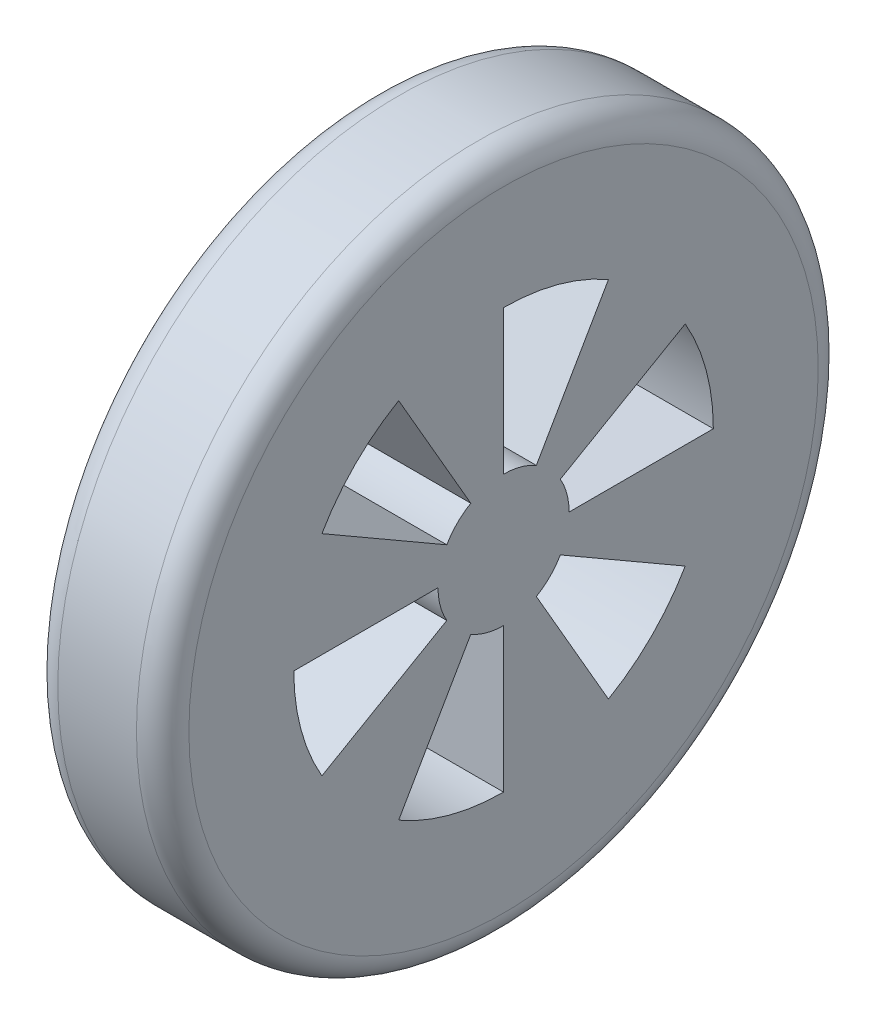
ISO-10303-21;
HEADER;
FILE_DESCRIPTION(('STEP AP214'),'2;1');
FILE_NAME('part.step','',(''),(''),'','','');
FILE_SCHEMA(('AUTOMOTIVE_DESIGN { 1 0 10303 214 1 1 1 1 }'));
ENDSEC;
DATA;
#1=APPLICATION_CONTEXT('core data for automotive mechanical design processes');
#2=APPLICATION_PROTOCOL_DEFINITION('international standard','automotive_design',2000,#1);
#3=PRODUCT_CONTEXT('',#1,'mechanical');
#4=PRODUCT('Part','Part','',(#3));
#5=PRODUCT_RELATED_PRODUCT_CATEGORY('part','',(#4));
#6=PRODUCT_DEFINITION_FORMATION('','',#4);
#7=PRODUCT_DEFINITION_CONTEXT('part definition',#1,'design');
#8=PRODUCT_DEFINITION('design','',#6,#7);
#9=PRODUCT_DEFINITION_SHAPE('','',#8);
#10=(LENGTH_UNIT() NAMED_UNIT(*) SI_UNIT(.MILLI.,.METRE.));
#11=(NAMED_UNIT(*) PLANE_ANGLE_UNIT() SI_UNIT($,.RADIAN.));
#12=(NAMED_UNIT(*) SI_UNIT($,.STERADIAN.) SOLID_ANGLE_UNIT());
#13=UNCERTAINTY_MEASURE_WITH_UNIT(LENGTH_MEASURE(1.E-05),#10,'distance_accuracy_value','');
#14=(GEOMETRIC_REPRESENTATION_CONTEXT(3) GLOBAL_UNCERTAINTY_ASSIGNED_CONTEXT((#13)) GLOBAL_UNIT_ASSIGNED_CONTEXT((#10,
#11,#12)) REPRESENTATION_CONTEXT('',''));
#15=CARTESIAN_POINT('',(0.,0.,0.));
#16=DIRECTION('',(0.,0.,1.));
#17=DIRECTION('',(1.,0.,0.));
#18=AXIS2_PLACEMENT_3D('',#15,#16,#17);
#19=CARTESIAN_POINT('',(-25.,0.,0.));
#20=DIRECTION('',(0.,0.,1.));
#21=DIRECTION('',(1.,0.,0.));
#22=AXIS2_PLACEMENT_3D('',#19,#20,#21);
#23=PLANE('',#22);
#24=DIRECTION('',(1.,0.,0.));
#25=VECTOR('',#24,1.);
#26=CARTESIAN_POINT('',(-25.,80.,0.));
#27=LINE('',#26,#25);
#28=CARTESIAN_POINT('',(-25.,80.,0.));
#29=VERTEX_POINT('',#28);
#30=CARTESIAN_POINT('',(25.,80.,0.));
#31=VERTEX_POINT('',#30);
#32=EDGE_CURVE('E385',#29,#31,#27,.T.);
#33=ORIENTED_EDGE('',*,*,#32,.T.);
#34=DIRECTION('',(0.,-1.,0.));
#35=VECTOR('',#34,1.);
#36=CARTESIAN_POINT('',(25.,0.,0.));
#37=LINE('',#36,#35);
#38=CARTESIAN_POINT('',(25.,25.,0.));
#39=VERTEX_POINT('',#38);
#40=EDGE_CURVE('E243',#31,#39,#37,.T.);
#41=ORIENTED_EDGE('',*,*,#40,.T.);
#42=DIRECTION('',(1.,0.,0.));
#43=VECTOR('',#42,1.);
#44=CARTESIAN_POINT('',(-25.,25.,0.));
#45=LINE('',#44,#43);
#46=CARTESIAN_POINT('',(-25.,25.,0.));
#47=VERTEX_POINT('',#46);
#48=EDGE_CURVE('E376',#47,#39,#45,.T.);
#49=ORIENTED_EDGE('',*,*,#48,.F.);
#50=DIRECTION('',(0.,-1.,0.));
#51=VECTOR('',#50,1.);
#52=CARTESIAN_POINT('',(-25.,0.,0.));
#53=LINE('',#52,#51);
#54=EDGE_CURVE('E59',#29,#47,#53,.T.);
#55=ORIENTED_EDGE('',*,*,#54,.F.);
#56=EDGE_LOOP('',(#33,#41,#49,#55));
#57=FACE_BOUND('',#56,.T.);
#58=ADVANCED_FACE('F43',(#57),#23,.F.);
#59=CARTESIAN_POINT('',(-25.,0.,0.));
#60=DIRECTION('',(1.,0.,0.));
#61=DIRECTION('',(0.,0.,-1.));
#62=AXIS2_PLACEMENT_3D('',#59,#60,#61);
#63=CYLINDRICAL_SURFACE('',#62,25.);
#64=ORIENTED_EDGE('',*,*,#48,.T.);
#65=CARTESIAN_POINT('',(25.,0.,0.));
#66=DIRECTION('',(1.,0.,0.));
#67=DIRECTION('',(0.,0.,-1.));
#68=AXIS2_PLACEMENT_3D('',#65,#66,#67);
#69=CIRCLE('',#68,25.);
#70=CARTESIAN_POINT('',(25.,21.650635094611,-12.5));
#71=VERTEX_POINT('',#70);
#72=EDGE_CURVE('E321',#71,#39,#69,.T.);
#73=ORIENTED_EDGE('',*,*,#72,.F.);
#74=DIRECTION('',(1.,0.,0.));
#75=VECTOR('',#74,1.);
#76=CARTESIAN_POINT('',(-25.,21.650635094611,-12.5));
#77=LINE('',#76,#75);
#78=CARTESIAN_POINT('',(-25.,21.650635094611,-12.5));
#79=VERTEX_POINT('',#78);
#80=EDGE_CURVE('E67',#79,#71,#77,.T.);
#81=ORIENTED_EDGE('',*,*,#80,.F.);
#82=CARTESIAN_POINT('',(-25.,0.,0.));
#83=DIRECTION('',(1.,0.,0.));
#84=DIRECTION('',(0.,0.,-1.));
#85=AXIS2_PLACEMENT_3D('',#82,#83,#84);
#86=CIRCLE('',#85,25.);
#87=EDGE_CURVE('E221',#79,#47,#86,.T.);
#88=ORIENTED_EDGE('',*,*,#87,.T.);
#89=EDGE_LOOP('',(#64,#73,#81,#88));
#90=FACE_BOUND('',#89,.T.);
#91=ADVANCED_FACE('F471',(#90),#63,.T.);
#92=CARTESIAN_POINT('',(-25.,0.,0.));
#93=DIRECTION('',(0.,0.500000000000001,0.866025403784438));
#94=DIRECTION('',(0.,-0.866025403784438,0.500000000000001));
#95=AXIS2_PLACEMENT_3D('',#92,#93,#94);
#96=PLANE('',#95);
#97=ORIENTED_EDGE('',*,*,#80,.T.);
#98=DIRECTION('',(0.,-0.866025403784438,0.500000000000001));
#99=VECTOR('',#98,1.);
#100=CARTESIAN_POINT('',(25.,0.,0.));
#101=LINE('',#100,#99);
#102=CARTESIAN_POINT('',(25.,69.2820323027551,-40.0000000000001));
#103=VERTEX_POINT('',#102);
#104=EDGE_CURVE('E242',#103,#71,#101,.T.);
#105=ORIENTED_EDGE('',*,*,#104,.F.);
#106=DIRECTION('',(1.,0.,0.));
#107=VECTOR('',#106,1.);
#108=CARTESIAN_POINT('',(-25.,69.2820323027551,-40.0000000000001));
#109=LINE('',#108,#107);
#110=CARTESIAN_POINT('',(-25.,69.2820323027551,-40.0000000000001));
#111=VERTEX_POINT('',#110);
#112=EDGE_CURVE('E382',#111,#103,#109,.T.);
#113=ORIENTED_EDGE('',*,*,#112,.F.);
#114=DIRECTION('',(0.,-0.866025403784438,0.500000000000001));
#115=VECTOR('',#114,1.);
#116=CARTESIAN_POINT('',(-25.,0.,0.));
#117=LINE('',#116,#115);
#118=EDGE_CURVE('E373',#111,#79,#117,.T.);
#119=ORIENTED_EDGE('',*,*,#118,.T.);
#120=EDGE_LOOP('',(#97,#105,#113,#119));
#121=FACE_BOUND('',#120,.T.);
#122=ADVANCED_FACE('F477',(#121),#96,.T.);
#123=CARTESIAN_POINT('',(-25.,0.,0.));
#124=DIRECTION('',(1.,0.,0.));
#125=DIRECTION('',(0.,0.,-1.));
#126=AXIS2_PLACEMENT_3D('',#123,#124,#125);
#127=CYLINDRICAL_SURFACE('',#126,80.);
#128=DIRECTION('',(1.,0.,0.));
#129=VECTOR('',#128,1.);
#130=CARTESIAN_POINT('',(-25.,69.2820323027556,39.9999999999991));
#131=LINE('',#130,#129);
#132=CARTESIAN_POINT('',(-25.,69.2820323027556,39.9999999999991));
#133=VERTEX_POINT('',#132);
#134=CARTESIAN_POINT('',(25.,69.2820323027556,39.9999999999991));
#135=VERTEX_POINT('',#134);
#136=EDGE_CURVE('E397',#133,#135,#131,.T.);
#137=ORIENTED_EDGE('',*,*,#136,.T.);
#138=CARTESIAN_POINT('',(25.,0.,0.));
#139=DIRECTION('',(1.,0.,0.));
#140=DIRECTION('',(0.,0.,-1.));
#141=AXIS2_PLACEMENT_3D('',#138,#139,#140);
#142=CIRCLE('',#141,80.);
#143=CARTESIAN_POINT('',(25.,40.0000000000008,69.2820323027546));
#144=VERTEX_POINT('',#143);
#145=EDGE_CURVE('E244',#135,#144,#142,.T.);
#146=ORIENTED_EDGE('',*,*,#145,.T.);
#147=DIRECTION('',(1.,0.,0.));
#148=VECTOR('',#147,1.);
#149=CARTESIAN_POINT('',(-25.,40.0000000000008,69.2820323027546));
#150=LINE('',#149,#148);
#151=CARTESIAN_POINT('',(-25.,40.0000000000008,69.2820323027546));
#152=VERTEX_POINT('',#151);
#153=EDGE_CURVE('E388',#152,#144,#150,.T.);
#154=ORIENTED_EDGE('',*,*,#153,.F.);
#155=CARTESIAN_POINT('',(-25.,0.,0.));
#156=DIRECTION('',(1.,0.,0.));
#157=DIRECTION('',(0.,0.,-1.));
#158=AXIS2_PLACEMENT_3D('',#155,#156,#157);
#159=CIRCLE('',#158,80.);
#160=EDGE_CURVE('E362',#133,#152,#159,.T.);
#161=ORIENTED_EDGE('',*,*,#160,.F.);
#162=EDGE_LOOP('',(#137,#146,#154,#161));
#163=FACE_BOUND('',#162,.T.);
#164=ADVANCED_FACE('F488',(#163),#127,.F.);
#165=CARTESIAN_POINT('',(-25.,0.,0.));
#166=DIRECTION('',(0.,-0.866025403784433,0.50000000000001));
#167=DIRECTION('',(0.,-0.50000000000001,-0.866025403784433));
#168=AXIS2_PLACEMENT_3D('',#165,#166,#167);
#169=PLANE('',#168);
#170=ORIENTED_EDGE('',*,*,#153,.T.);
#171=DIRECTION('',(0.,-0.50000000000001,-0.866025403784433));
#172=VECTOR('',#171,1.);
#173=CARTESIAN_POINT('',(25.,0.,0.));
#174=LINE('',#173,#172);
#175=CARTESIAN_POINT('',(25.,12.5000000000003,21.6506350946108));
#176=VERTEX_POINT('',#175);
#177=EDGE_CURVE('E311',#144,#176,#174,.T.);
#178=ORIENTED_EDGE('',*,*,#177,.T.);
#179=DIRECTION('',(1.,0.,0.));
#180=VECTOR('',#179,1.);
#181=CARTESIAN_POINT('',(-25.,12.5000000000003,21.6506350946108));
#182=LINE('',#181,#180);
#183=CARTESIAN_POINT('',(-25.,12.5000000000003,21.6506350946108));
#184=VERTEX_POINT('',#183);
#185=EDGE_CURVE('E391',#184,#176,#182,.T.);
#186=ORIENTED_EDGE('',*,*,#185,.F.);
#187=DIRECTION('',(0.,-0.50000000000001,-0.866025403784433));
#188=VECTOR('',#187,1.);
#189=CARTESIAN_POINT('',(-25.,0.,0.));
#190=LINE('',#189,#188);
#191=EDGE_CURVE('E368',#152,#184,#190,.T.);
#192=ORIENTED_EDGE('',*,*,#191,.F.);
#193=EDGE_LOOP('',(#170,#178,#186,#192));
#194=FACE_BOUND('',#193,.T.);
#195=ADVANCED_FACE('F485',(#194),#169,.F.);
#196=ORIENTED_EDGE('',*,*,#185,.T.);
#197=CARTESIAN_POINT('',(25.,21.6506350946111,12.4999999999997));
#198=VERTEX_POINT('',#197);
#199=EDGE_CURVE('E301',#198,#176,#69,.T.);
#200=ORIENTED_EDGE('',*,*,#199,.F.);
#201=DIRECTION('',(1.,0.,0.));
#202=VECTOR('',#201,1.);
#203=CARTESIAN_POINT('',(-25.,21.6506350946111,12.4999999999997));
#204=LINE('',#203,#202);
#205=CARTESIAN_POINT('',(-25.,21.6506350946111,12.4999999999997));
#206=VERTEX_POINT('',#205);
#207=EDGE_CURVE('E394',#206,#198,#204,.T.);
#208=ORIENTED_EDGE('',*,*,#207,.F.);
#209=EDGE_CURVE('E367',#206,#184,#86,.T.);
#210=ORIENTED_EDGE('',*,*,#209,.T.);
#211=EDGE_LOOP('',(#196,#200,#208,#210));
#212=FACE_BOUND('',#211,.T.);
#213=ADVANCED_FACE('F480',(#212),#63,.T.);
#214=DIRECTION('',(1.,0.,0.));
#215=VECTOR('',#214,1.);
#216=CARTESIAN_POINT('',(-25.,-1.84625237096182E-12,79.9999999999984));
#217=LINE('',#216,#215);
#218=CARTESIAN_POINT('',(-25.,-1.84625237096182E-12,79.9999999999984));
#219=VERTEX_POINT('',#218);
#220=CARTESIAN_POINT('',(25.,-1.84625237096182E-12,79.9999999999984));
#221=VERTEX_POINT('',#220);
#222=EDGE_CURVE('E409',#219,#221,#217,.T.);
#223=ORIENTED_EDGE('',*,*,#222,.T.);
#224=CARTESIAN_POINT('',(25.,-40.0000000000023,69.2820323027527));
#225=VERTEX_POINT('',#224);
#226=EDGE_CURVE('E263',#221,#225,#142,.T.);
#227=ORIENTED_EDGE('',*,*,#226,.T.);
#228=DIRECTION('',(1.,0.,0.));
#229=VECTOR('',#228,1.);
#230=CARTESIAN_POINT('',(-25.,-40.0000000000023,69.2820323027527));
#231=LINE('',#230,#229);
#232=CARTESIAN_POINT('',(-25.,-40.0000000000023,69.2820323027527));
#233=VERTEX_POINT('',#232);
#234=EDGE_CURVE('E400',#233,#225,#231,.T.);
#235=ORIENTED_EDGE('',*,*,#234,.F.);
#236=EDGE_CURVE('E353',#219,#233,#159,.T.);
#237=ORIENTED_EDGE('',*,*,#236,.F.);
#238=EDGE_LOOP('',(#223,#227,#235,#237));
#239=FACE_BOUND('',#238,.T.);
#240=ADVANCED_FACE('F499',(#239),#127,.F.);
#241=CARTESIAN_POINT('',(-25.,-2.76425886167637E-12,-1.59594559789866E-12));
#242=DIRECTION('',(0.,-0.866025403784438,-0.5));
#243=DIRECTION('',(0.,0.5,-0.866025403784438));
#244=AXIS2_PLACEMENT_3D('',#241,#242,#243);
#245=PLANE('',#244);
#246=ORIENTED_EDGE('',*,*,#234,.T.);
#247=DIRECTION('',(0.,0.5,-0.866025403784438));
#248=VECTOR('',#247,1.);
#249=CARTESIAN_POINT('',(25.,-2.76425886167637E-12,-1.59594559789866E-12));
#250=LINE('',#249,#248);
#251=CARTESIAN_POINT('',(25.,-12.5000000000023,21.6506350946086));
#252=VERTEX_POINT('',#251);
#253=EDGE_CURVE('E293',#225,#252,#250,.T.);
#254=ORIENTED_EDGE('',*,*,#253,.T.);
#255=DIRECTION('',(1.,0.,0.));
#256=VECTOR('',#255,1.);
#257=CARTESIAN_POINT('',(-25.,-12.5000000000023,21.6506350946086));
#258=LINE('',#257,#256);
#259=CARTESIAN_POINT('',(-25.,-12.5000000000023,21.6506350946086));
#260=VERTEX_POINT('',#259);
#261=EDGE_CURVE('E403',#260,#252,#258,.T.);
#262=ORIENTED_EDGE('',*,*,#261,.F.);
#263=DIRECTION('',(0.,0.5,-0.866025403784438));
#264=VECTOR('',#263,1.);
#265=CARTESIAN_POINT('',(-25.,-2.76425886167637E-12,-1.59594559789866E-12));
#266=LINE('',#265,#264);
#267=EDGE_CURVE('E359',#233,#260,#266,.T.);
#268=ORIENTED_EDGE('',*,*,#267,.F.);
#269=EDGE_LOOP('',(#246,#254,#262,#268));
#270=FACE_BOUND('',#269,.T.);
#271=ADVANCED_FACE('F495',(#270),#245,.F.);
#272=ORIENTED_EDGE('',*,*,#261,.T.);
#273=CARTESIAN_POINT('',(25.,-1.84639360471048E-12,24.9999999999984));
#274=VERTEX_POINT('',#273);
#275=EDGE_CURVE('E286',#274,#252,#69,.T.);
#276=ORIENTED_EDGE('',*,*,#275,.F.);
#277=DIRECTION('',(1.,0.,0.));
#278=VECTOR('',#277,1.);
#279=CARTESIAN_POINT('',(-25.,-1.84639360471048E-12,24.9999999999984));
#280=LINE('',#279,#278);
#281=CARTESIAN_POINT('',(-25.,-1.84639360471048E-12,24.9999999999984));
#282=VERTEX_POINT('',#281);
#283=EDGE_CURVE('E406',#282,#274,#280,.T.);
#284=ORIENTED_EDGE('',*,*,#283,.F.);
#285=EDGE_CURVE('E358',#282,#260,#86,.T.);
#286=ORIENTED_EDGE('',*,*,#285,.T.);
#287=EDGE_LOOP('',(#272,#276,#284,#286));
#288=FACE_BOUND('',#287,.T.);
#289=ADVANCED_FACE('F498',(#288),#63,.T.);
#290=DIRECTION('',(1.,0.,0.));
#291=VECTOR('',#290,1.);
#292=CARTESIAN_POINT('',(-25.,-69.282032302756,39.9999999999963));
#293=LINE('',#292,#291);
#294=CARTESIAN_POINT('',(-25.,-69.282032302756,39.9999999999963));
#295=VERTEX_POINT('',#294);
#296=CARTESIAN_POINT('',(25.,-69.282032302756,39.9999999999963));
#297=VERTEX_POINT('',#296);
#298=EDGE_CURVE('E421',#295,#297,#293,.T.);
#299=ORIENTED_EDGE('',*,*,#298,.T.);
#300=CARTESIAN_POINT('',(25.,-80.,-4.26080712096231E-12));
#301=VERTEX_POINT('',#300);
#302=EDGE_CURVE('E248',#297,#301,#142,.T.);
#303=ORIENTED_EDGE('',*,*,#302,.T.);
#304=DIRECTION('',(1.,0.,0.));
#305=VECTOR('',#304,1.);
#306=CARTESIAN_POINT('',(-25.,-80.,-4.26080712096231E-12));
#307=LINE('',#306,#305);
#308=CARTESIAN_POINT('',(-25.,-80.,-4.26080712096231E-12));
#309=VERTEX_POINT('',#308);
#310=EDGE_CURVE('E412',#309,#301,#307,.T.);
#311=ORIENTED_EDGE('',*,*,#310,.F.);
#312=EDGE_CURVE('E344',#295,#309,#159,.T.);
#313=ORIENTED_EDGE('',*,*,#312,.F.);
#314=EDGE_LOOP('',(#299,#303,#311,#313));
#315=FACE_BOUND('',#314,.T.);
#316=ADVANCED_FACE('F508',(#315),#127,.F.);
#317=CARTESIAN_POINT('',(-25.,0.,-4.25100994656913E-12));
#318=DIRECTION('',(0.,0.,-1.));
#319=DIRECTION('',(0.,1.,0.));
#320=AXIS2_PLACEMENT_3D('',#317,#318,#319);
#321=PLANE('',#320);
#322=ORIENTED_EDGE('',*,*,#310,.T.);
#323=DIRECTION('',(0.,1.,0.));
#324=VECTOR('',#323,1.);
#325=CARTESIAN_POINT('',(25.,0.,-4.25100994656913E-12));
#326=LINE('',#325,#324);
#327=CARTESIAN_POINT('',(25.,-25.,-4.254071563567E-12));
#328=VERTEX_POINT('',#327);
#329=EDGE_CURVE('E278',#301,#328,#326,.T.);
#330=ORIENTED_EDGE('',*,*,#329,.T.);
#331=DIRECTION('',(1.,0.,0.));
#332=VECTOR('',#331,1.);
#333=CARTESIAN_POINT('',(-25.,-25.,-4.254071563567E-12));
#334=LINE('',#333,#332);
#335=CARTESIAN_POINT('',(-25.,-25.,-4.254071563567E-12));
#336=VERTEX_POINT('',#335);
#337=EDGE_CURVE('E415',#336,#328,#334,.T.);
#338=ORIENTED_EDGE('',*,*,#337,.F.);
#339=DIRECTION('',(0.,1.,0.));
#340=VECTOR('',#339,1.);
#341=CARTESIAN_POINT('',(-25.,0.,-4.25100994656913E-12));
#342=LINE('',#341,#340);
#343=EDGE_CURVE('E350',#309,#336,#342,.T.);
#344=ORIENTED_EDGE('',*,*,#343,.F.);
#345=EDGE_LOOP('',(#322,#330,#338,#344));
#346=FACE_BOUND('',#345,.T.);
#347=ADVANCED_FACE('F504',(#346),#321,.F.);
#348=ORIENTED_EDGE('',*,*,#337,.T.);
#349=CARTESIAN_POINT('',(25.,-21.6506350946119,12.4999999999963));
#350=VERTEX_POINT('',#349);
#351=EDGE_CURVE('E271',#350,#328,#69,.T.);
#352=ORIENTED_EDGE('',*,*,#351,.F.);
#353=DIRECTION('',(1.,0.,0.));
#354=VECTOR('',#353,1.);
#355=CARTESIAN_POINT('',(-25.,-21.6506350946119,12.4999999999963));
#356=LINE('',#355,#354);
#357=CARTESIAN_POINT('',(-25.,-21.6506350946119,12.4999999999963));
#358=VERTEX_POINT('',#357);
#359=EDGE_CURVE('E418',#358,#350,#356,.T.);
#360=ORIENTED_EDGE('',*,*,#359,.F.);
#361=EDGE_CURVE('E349',#358,#336,#86,.T.);
#362=ORIENTED_EDGE('',*,*,#361,.T.);
#363=EDGE_LOOP('',(#348,#352,#360,#362));
#364=FACE_BOUND('',#363,.T.);
#365=ADVANCED_FACE('F507',(#364),#63,.T.);
#366=DIRECTION('',(1.,0.,0.));
#367=VECTOR('',#366,1.);
#368=CARTESIAN_POINT('',(-25.,-69.2820323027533,-40.0000000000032));
#369=LINE('',#368,#367);
#370=CARTESIAN_POINT('',(-25.,-69.2820323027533,-40.0000000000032));
#371=VERTEX_POINT('',#370);
#372=CARTESIAN_POINT('',(25.,-69.2820323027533,-40.0000000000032));
#373=VERTEX_POINT('',#372);
#374=EDGE_CURVE('E433',#371,#373,#369,.T.);
#375=ORIENTED_EDGE('',*,*,#374,.T.);
#376=CARTESIAN_POINT('',(25.,-39.9999999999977,-69.2820323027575));
#377=VERTEX_POINT('',#376);
#378=EDGE_CURVE('E239',#373,#377,#142,.T.);
#379=ORIENTED_EDGE('',*,*,#378,.T.);
#380=DIRECTION('',(1.,0.,0.));
#381=VECTOR('',#380,1.);
#382=CARTESIAN_POINT('',(-25.,-39.9999999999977,-69.2820323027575));
#383=LINE('',#382,#381);
#384=CARTESIAN_POINT('',(-25.,-39.9999999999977,-69.2820323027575));
#385=VERTEX_POINT('',#384);
#386=EDGE_CURVE('E424',#385,#377,#383,.T.);
#387=ORIENTED_EDGE('',*,*,#386,.F.);
#388=EDGE_CURVE('E326',#371,#385,#159,.T.);
#389=ORIENTED_EDGE('',*,*,#388,.F.);
#390=EDGE_LOOP('',(#375,#379,#387,#389));
#391=FACE_BOUND('',#390,.T.);
#392=ADVANCED_FACE('F518',(#391),#127,.F.);
#393=CARTESIAN_POINT('',(-25.,2.75824960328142E-12,-1.59247615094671E-12));
#394=DIRECTION('',(0.,0.866025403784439,-0.5));
#395=DIRECTION('',(0.,0.5,0.866025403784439));
#396=AXIS2_PLACEMENT_3D('',#393,#394,#395);
#397=PLANE('',#396);
#398=ORIENTED_EDGE('',*,*,#386,.T.);
#399=DIRECTION('',(0.,0.5,0.866025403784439));
#400=VECTOR('',#399,1.);
#401=CARTESIAN_POINT('',(25.,2.75824960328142E-12,-1.59247615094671E-12));
#402=LINE('',#401,#400);
#403=CARTESIAN_POINT('',(25.,-12.4999999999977,-21.6506350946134));
#404=VERTEX_POINT('',#403);
#405=EDGE_CURVE('E262',#377,#404,#402,.T.);
#406=ORIENTED_EDGE('',*,*,#405,.T.);
#407=DIRECTION('',(1.,0.,0.));
#408=VECTOR('',#407,1.);
#409=CARTESIAN_POINT('',(-25.,-12.4999999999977,-21.6506350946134));
#410=LINE('',#409,#408);
#411=CARTESIAN_POINT('',(-25.,-12.4999999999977,-21.6506350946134));
#412=VERTEX_POINT('',#411);
#413=EDGE_CURVE('E427',#412,#404,#410,.T.);
#414=ORIENTED_EDGE('',*,*,#413,.F.);
#415=DIRECTION('',(0.,0.5,0.866025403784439));
#416=VECTOR('',#415,1.);
#417=CARTESIAN_POINT('',(-25.,2.75824960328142E-12,-1.59247615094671E-12));
#418=LINE('',#417,#416);
#419=EDGE_CURVE('E341',#385,#412,#418,.T.);
#420=ORIENTED_EDGE('',*,*,#419,.F.);
#421=EDGE_LOOP('',(#398,#406,#414,#420));
#422=FACE_BOUND('',#421,.T.);
#423=ADVANCED_FACE('F514',(#422),#397,.F.);
#424=ORIENTED_EDGE('',*,*,#413,.T.);
#425=CARTESIAN_POINT('',(25.,-21.6506350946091,-12.5000000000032));
#426=VERTEX_POINT('',#425);
#427=EDGE_CURVE('E256',#426,#404,#69,.T.);
#428=ORIENTED_EDGE('',*,*,#427,.F.);
#429=DIRECTION('',(1.,0.,0.));
#430=VECTOR('',#429,1.);
#431=CARTESIAN_POINT('',(-25.,-21.6506350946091,-12.5000000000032));
#432=LINE('',#431,#430);
#433=CARTESIAN_POINT('',(-25.,-21.6506350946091,-12.5000000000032));
#434=VERTEX_POINT('',#433);
#435=EDGE_CURVE('E430',#434,#426,#432,.T.);
#436=ORIENTED_EDGE('',*,*,#435,.F.);
#437=EDGE_CURVE('E334',#434,#412,#86,.T.);
#438=ORIENTED_EDGE('',*,*,#437,.T.);
#439=EDGE_LOOP('',(#424,#428,#436,#438));
#440=FACE_BOUND('',#439,.T.);
#441=ADVANCED_FACE('F517',(#440),#63,.T.);
#442=DIRECTION('',(1.,0.,0.));
#443=VECTOR('',#442,1.);
#444=CARTESIAN_POINT('',(-25.,-2.77555756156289E-13,-80.));
#445=LINE('',#444,#443);
#446=CARTESIAN_POINT('',(-25.,-2.77555756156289E-13,-80.));
#447=VERTEX_POINT('',#446);
#448=CARTESIAN_POINT('',(25.,-2.77555756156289E-13,-80.));
#449=VERTEX_POINT('',#448);
#450=EDGE_CURVE('E207',#447,#449,#445,.T.);
#451=ORIENTED_EDGE('',*,*,#450,.T.);
#452=CARTESIAN_POINT('',(25.,39.9999999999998,-69.2820323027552));
#453=VERTEX_POINT('',#452);
#454=EDGE_CURVE('E212',#449,#453,#142,.T.);
#455=ORIENTED_EDGE('',*,*,#454,.T.);
#456=DIRECTION('',(1.,0.,0.));
#457=VECTOR('',#456,1.);
#458=CARTESIAN_POINT('',(-25.,39.9999999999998,-69.2820323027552));
#459=LINE('',#458,#457);
#460=CARTESIAN_POINT('',(-25.,39.9999999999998,-69.2820323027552));
#461=VERTEX_POINT('',#460);
#462=EDGE_CURVE('E436',#461,#453,#459,.T.);
#463=ORIENTED_EDGE('',*,*,#462,.F.);
#464=EDGE_CURVE('E215',#447,#461,#159,.T.);
#465=ORIENTED_EDGE('',*,*,#464,.F.);
#466=EDGE_LOOP('',(#451,#455,#463,#465));
#467=FACE_BOUND('',#466,.T.);
#468=ADVANCED_FACE('F209',(#467),#127,.F.);
#469=CARTESIAN_POINT('',(-25.,0.,0.));
#470=DIRECTION('',(0.,0.86602540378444,0.499999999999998));
#471=DIRECTION('',(0.,-0.499999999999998,0.86602540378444));
#472=AXIS2_PLACEMENT_3D('',#469,#470,#471);
#473=PLANE('',#472);
#474=ORIENTED_EDGE('',*,*,#462,.T.);
#475=DIRECTION('',(0.,-0.499999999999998,0.86602540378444));
#476=VECTOR('',#475,1.);
#477=CARTESIAN_POINT('',(25.,0.,0.));
#478=LINE('',#477,#476);
#479=CARTESIAN_POINT('',(25.,12.4999999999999,-21.650635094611));
#480=VERTEX_POINT('',#479);
#481=EDGE_CURVE('E235',#453,#480,#478,.T.);
#482=ORIENTED_EDGE('',*,*,#481,.T.);
#483=DIRECTION('',(1.,0.,0.));
#484=VECTOR('',#483,1.);
#485=CARTESIAN_POINT('',(-25.,12.4999999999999,-21.650635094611));
#486=LINE('',#485,#484);
#487=CARTESIAN_POINT('',(-25.,12.4999999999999,-21.650635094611));
#488=VERTEX_POINT('',#487);
#489=EDGE_CURVE('E439',#488,#480,#486,.T.);
#490=ORIENTED_EDGE('',*,*,#489,.F.);
#491=DIRECTION('',(0.,-0.499999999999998,0.86602540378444));
#492=VECTOR('',#491,1.);
#493=CARTESIAN_POINT('',(-25.,0.,0.));
#494=LINE('',#493,#492);
#495=EDGE_CURVE('E333',#461,#488,#494,.T.);
#496=ORIENTED_EDGE('',*,*,#495,.F.);
#497=EDGE_LOOP('',(#474,#482,#490,#496));
#498=FACE_BOUND('',#497,.T.);
#499=ADVANCED_FACE('F523',(#498),#473,.F.);
#500=ORIENTED_EDGE('',*,*,#489,.T.);
#501=CARTESIAN_POINT('',(25.,0.,-25.));
#502=VERTEX_POINT('',#501);
#503=EDGE_CURVE('E230',#502,#480,#69,.T.);
#504=ORIENTED_EDGE('',*,*,#503,.F.);
#505=DIRECTION('',(1.,0.,0.));
#506=VECTOR('',#505,1.);
#507=CARTESIAN_POINT('',(-25.,0.,-25.));
#508=LINE('',#507,#506);
#509=CARTESIAN_POINT('',(-25.,0.,-25.));
#510=VERTEX_POINT('',#509);
#511=EDGE_CURVE('E220',#510,#502,#508,.T.);
#512=ORIENTED_EDGE('',*,*,#511,.F.);
#513=EDGE_CURVE('E329',#510,#488,#86,.T.);
#514=ORIENTED_EDGE('',*,*,#513,.T.);
#515=EDGE_LOOP('',(#500,#504,#512,#514));
#516=FACE_BOUND('',#515,.T.);
#517=ADVANCED_FACE('F479',(#516),#63,.T.);
#518=ORIENTED_EDGE('',*,*,#112,.T.);
#519=EDGE_CURVE('E238',#103,#31,#142,.T.);
#520=ORIENTED_EDGE('',*,*,#519,.T.);
#521=ORIENTED_EDGE('',*,*,#32,.F.);
#522=EDGE_CURVE('E325',#111,#29,#159,.T.);
#523=ORIENTED_EDGE('',*,*,#522,.F.);
#524=EDGE_LOOP('',(#518,#520,#521,#523));
#525=FACE_BOUND('',#524,.T.);
#526=ADVANCED_FACE('F483',(#525),#127,.F.);
#527=CARTESIAN_POINT('',(-25.,0.,0.));
#528=DIRECTION('',(0.,-0.499999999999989,0.866025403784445));
#529=DIRECTION('',(0.,-0.866025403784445,-0.499999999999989));
#530=AXIS2_PLACEMENT_3D('',#527,#528,#529);
#531=PLANE('',#530);
#532=ORIENTED_EDGE('',*,*,#207,.T.);
#533=DIRECTION('',(0.,-0.866025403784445,-0.499999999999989));
#534=VECTOR('',#533,1.);
#535=CARTESIAN_POINT('',(25.,0.,0.));
#536=LINE('',#535,#534);
#537=EDGE_CURVE('E292',#135,#198,#536,.T.);
#538=ORIENTED_EDGE('',*,*,#537,.F.);
#539=ORIENTED_EDGE('',*,*,#136,.F.);
#540=DIRECTION('',(0.,-0.866025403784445,-0.499999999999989));
#541=VECTOR('',#540,1.);
#542=CARTESIAN_POINT('',(-25.,0.,0.));
#543=LINE('',#542,#541);
#544=EDGE_CURVE('E363',#133,#206,#543,.T.);
#545=ORIENTED_EDGE('',*,*,#544,.T.);
#546=EDGE_LOOP('',(#532,#538,#539,#545));
#547=FACE_BOUND('',#546,.T.);
#548=ADVANCED_FACE('F490',(#547),#531,.T.);
#549=CARTESIAN_POINT('',(-25.,-1.84645780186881E-12,0.));
#550=DIRECTION('',(0.,-1.,0.));
#551=DIRECTION('',(0.,0.,-1.));
#552=AXIS2_PLACEMENT_3D('',#549,#550,#551);
#553=PLANE('',#552);
#554=ORIENTED_EDGE('',*,*,#283,.T.);
#555=DIRECTION('',(0.,0.,-1.));
#556=VECTOR('',#555,1.);
#557=CARTESIAN_POINT('',(25.,-1.84645780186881E-12,0.));
#558=LINE('',#557,#556);
#559=EDGE_CURVE('E277',#221,#274,#558,.T.);
#560=ORIENTED_EDGE('',*,*,#559,.F.);
#561=ORIENTED_EDGE('',*,*,#222,.F.);
#562=DIRECTION('',(0.,0.,-1.));
#563=VECTOR('',#562,1.);
#564=CARTESIAN_POINT('',(-25.,-1.84645780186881E-12,0.));
#565=LINE('',#564,#563);
#566=EDGE_CURVE('E354',#219,#282,#565,.T.);
#567=ORIENTED_EDGE('',*,*,#566,.T.);
#568=EDGE_LOOP('',(#554,#560,#561,#567));
#569=FACE_BOUND('',#568,.T.);
#570=ADVANCED_FACE('F493',(#569),#553,.T.);
#571=CARTESIAN_POINT('',(-25.,-1.83880688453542E-12,-3.18490694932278E-12));
#572=DIRECTION('',(0.,-0.5,-0.866025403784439));
#573=DIRECTION('',(0.,0.866025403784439,-0.5));
#574=AXIS2_PLACEMENT_3D('',#571,#572,#573);
#575=PLANE('',#574);
#576=ORIENTED_EDGE('',*,*,#359,.T.);
#577=DIRECTION('',(0.,0.866025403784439,-0.5));
#578=VECTOR('',#577,1.);
#579=CARTESIAN_POINT('',(25.,-1.83880688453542E-12,-3.18490694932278E-12));
#580=LINE('',#579,#578);
#581=EDGE_CURVE('E261',#297,#350,#580,.T.);
#582=ORIENTED_EDGE('',*,*,#581,.F.);
#583=ORIENTED_EDGE('',*,*,#298,.F.);
#584=DIRECTION('',(0.,0.866025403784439,-0.5));
#585=VECTOR('',#584,1.);
#586=CARTESIAN_POINT('',(-25.,-1.83880688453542E-12,-3.18490694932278E-12));
#587=LINE('',#586,#585);
#588=EDGE_CURVE('E345',#295,#358,#587,.T.);
#589=ORIENTED_EDGE('',*,*,#588,.T.);
#590=EDGE_LOOP('',(#576,#582,#583,#589));
#591=FACE_BOUND('',#590,.T.);
#592=ADVANCED_FACE('F502',(#591),#575,.T.);
#593=CARTESIAN_POINT('',(-25.,1.84574577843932E-12,-3.19692546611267E-12));
#594=DIRECTION('',(0.,0.5,-0.866025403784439));
#595=DIRECTION('',(0.,0.866025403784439,0.5));
#596=AXIS2_PLACEMENT_3D('',#593,#594,#595);
#597=PLANE('',#596);
#598=ORIENTED_EDGE('',*,*,#435,.T.);
#599=DIRECTION('',(0.,0.866025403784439,0.5));
#600=VECTOR('',#599,1.);
#601=CARTESIAN_POINT('',(25.,1.84574577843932E-12,-3.19692546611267E-12));
#602=LINE('',#601,#600);
#603=EDGE_CURVE('E247',#373,#426,#602,.T.);
#604=ORIENTED_EDGE('',*,*,#603,.F.);
#605=ORIENTED_EDGE('',*,*,#374,.F.);
#606=DIRECTION('',(0.,0.866025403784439,0.5));
#607=VECTOR('',#606,1.);
#608=CARTESIAN_POINT('',(-25.,1.84574577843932E-12,-3.19692546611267E-12));
#609=LINE('',#608,#607);
#610=EDGE_CURVE('E337',#371,#434,#609,.T.);
#611=ORIENTED_EDGE('',*,*,#610,.T.);
#612=EDGE_LOOP('',(#598,#604,#605,#611));
#613=FACE_BOUND('',#612,.T.);
#614=ADVANCED_FACE('F512',(#613),#597,.T.);
#615=CARTESIAN_POINT('',(-25.,0.,0.));
#616=DIRECTION('',(0.,1.,0.));
#617=DIRECTION('',(0.,0.,1.));
#618=AXIS2_PLACEMENT_3D('',#615,#616,#617);
#619=PLANE('',#618);
#620=ORIENTED_EDGE('',*,*,#511,.T.);
#621=DIRECTION('',(0.,0.,1.));
#622=VECTOR('',#621,1.);
#623=CARTESIAN_POINT('',(25.,0.,0.));
#624=LINE('',#623,#622);
#625=EDGE_CURVE('E224',#449,#502,#624,.T.);
#626=ORIENTED_EDGE('',*,*,#625,.F.);
#627=ORIENTED_EDGE('',*,*,#450,.F.);
#628=DIRECTION('',(0.,0.,1.));
#629=VECTOR('',#628,1.);
#630=CARTESIAN_POINT('',(-25.,0.,0.));
#631=LINE('',#630,#629);
#632=EDGE_CURVE('E324',#447,#510,#631,.T.);
#633=ORIENTED_EDGE('',*,*,#632,.T.);
#634=EDGE_LOOP('',(#620,#626,#627,#633));
#635=FACE_BOUND('',#634,.T.);
#636=ADVANCED_FACE('F225',(#635),#619,.T.);
#637=CARTESIAN_POINT('',(-25.,0.,0.));
#638=DIRECTION('',(1.,0.,0.));
#639=DIRECTION('',(0.,0.,-1.));
#640=AXIS2_PLACEMENT_3D('',#637,#638,#639);
#641=CYLINDRICAL_SURFACE('',#640,130.);
#642=CARTESIAN_POINT('',(15.,0.,0.));
#643=DIRECTION('',(1.,0.,0.));
#644=DIRECTION('',(0.,0.,-1.));
#645=AXIS2_PLACEMENT_3D('',#642,#643,#644);
#646=CIRCLE('',#645,130.);
#647=CARTESIAN_POINT('',(15.,0.,-130.));
#648=VERTEX_POINT('',#647);
#649=EDGE_CURVE('E52',#648,#648,#646,.F.);
#650=ORIENTED_EDGE('',*,*,#649,.T.);
#651=EDGE_LOOP('',(#650));
#652=FACE_BOUND('',#651,.T.);
#653=CARTESIAN_POINT('',(-15.,0.,0.));
#654=DIRECTION('',(1.,0.,0.));
#655=DIRECTION('',(0.,0.,-1.));
#656=AXIS2_PLACEMENT_3D('',#653,#654,#655);
#657=CIRCLE('',#656,130.);
#658=CARTESIAN_POINT('',(-15.,0.,-130.));
#659=VERTEX_POINT('',#658);
#660=EDGE_CURVE('E447',#659,#659,#657,.T.);
#661=ORIENTED_EDGE('',*,*,#660,.T.);
#662=EDGE_LOOP('',(#661));
#663=FACE_BOUND('',#662,.T.);
#664=ADVANCED_FACE('F454',(#652,#663),#641,.T.);
#665=CARTESIAN_POINT('',(-25.,0.,0.));
#666=DIRECTION('',(1.,0.,0.));
#667=DIRECTION('',(0.,0.,-1.));
#668=AXIS2_PLACEMENT_3D('',#665,#666,#667);
#669=PLANE('',#668);
#670=CARTESIAN_POINT('',(-25.,0.,0.));
#671=DIRECTION('',(1.,0.,0.));
#672=DIRECTION('',(0.,0.,-1.));
#673=AXIS2_PLACEMENT_3D('',#670,#671,#672);
#674=CIRCLE('',#673,120.);
#675=CARTESIAN_POINT('',(-25.,0.,-120.));
#676=VERTEX_POINT('',#675);
#677=EDGE_CURVE('E11',#676,#676,#674,.F.);
#678=ORIENTED_EDGE('',*,*,#677,.T.);
#679=EDGE_LOOP('',(#678));
#680=FACE_BOUND('',#679,.T.);
#681=ORIENTED_EDGE('',*,*,#464,.T.);
#682=ORIENTED_EDGE('',*,*,#495,.T.);
#683=ORIENTED_EDGE('',*,*,#513,.F.);
#684=ORIENTED_EDGE('',*,*,#632,.F.);
#685=EDGE_LOOP('',(#681,#682,#683,#684));
#686=FACE_BOUND('',#685,.T.);
#687=ORIENTED_EDGE('',*,*,#388,.T.);
#688=ORIENTED_EDGE('',*,*,#419,.T.);
#689=ORIENTED_EDGE('',*,*,#437,.F.);
#690=ORIENTED_EDGE('',*,*,#610,.F.);
#691=EDGE_LOOP('',(#687,#688,#689,#690));
#692=FACE_BOUND('',#691,.T.);
#693=ORIENTED_EDGE('',*,*,#312,.T.);
#694=ORIENTED_EDGE('',*,*,#343,.T.);
#695=ORIENTED_EDGE('',*,*,#361,.F.);
#696=ORIENTED_EDGE('',*,*,#588,.F.);
#697=EDGE_LOOP('',(#693,#694,#695,#696));
#698=FACE_BOUND('',#697,.T.);
#699=ORIENTED_EDGE('',*,*,#236,.T.);
#700=ORIENTED_EDGE('',*,*,#267,.T.);
#701=ORIENTED_EDGE('',*,*,#285,.F.);
#702=ORIENTED_EDGE('',*,*,#566,.F.);
#703=EDGE_LOOP('',(#699,#700,#701,#702));
#704=FACE_BOUND('',#703,.T.);
#705=ORIENTED_EDGE('',*,*,#160,.T.);
#706=ORIENTED_EDGE('',*,*,#191,.T.);
#707=ORIENTED_EDGE('',*,*,#209,.F.);
#708=ORIENTED_EDGE('',*,*,#544,.F.);
#709=EDGE_LOOP('',(#705,#706,#707,#708));
#710=FACE_BOUND('',#709,.T.);
#711=ORIENTED_EDGE('',*,*,#54,.T.);
#712=ORIENTED_EDGE('',*,*,#87,.F.);
#713=ORIENTED_EDGE('',*,*,#118,.F.);
#714=ORIENTED_EDGE('',*,*,#522,.T.);
#715=EDGE_LOOP('',(#711,#712,#713,#714));
#716=FACE_BOUND('',#715,.T.);
#717=ADVANCED_FACE('F463',(#680,#686,#692,#698,#704,#710,#716),#669,.F.);
#718=CARTESIAN_POINT('',(25.,0.,0.));
#719=DIRECTION('',(1.,0.,0.));
#720=DIRECTION('',(0.,0.,-1.));
#721=AXIS2_PLACEMENT_3D('',#718,#719,#720);
#722=PLANE('',#721);
#723=CARTESIAN_POINT('',(25.,0.,0.));
#724=DIRECTION('',(1.,0.,0.));
#725=DIRECTION('',(0.,0.,-1.));
#726=AXIS2_PLACEMENT_3D('',#723,#724,#725);
#727=CIRCLE('',#726,120.);
#728=CARTESIAN_POINT('',(25.,0.,-120.));
#729=VERTEX_POINT('',#728);
#730=EDGE_CURVE('E379',#729,#729,#727,.T.);
#731=ORIENTED_EDGE('',*,*,#730,.T.);
#732=EDGE_LOOP('',(#731));
#733=FACE_BOUND('',#732,.T.);
#734=ORIENTED_EDGE('',*,*,#454,.F.);
#735=ORIENTED_EDGE('',*,*,#625,.T.);
#736=ORIENTED_EDGE('',*,*,#503,.T.);
#737=ORIENTED_EDGE('',*,*,#481,.F.);
#738=EDGE_LOOP('',(#734,#735,#736,#737));
#739=FACE_BOUND('',#738,.T.);
#740=ORIENTED_EDGE('',*,*,#378,.F.);
#741=ORIENTED_EDGE('',*,*,#603,.T.);
#742=ORIENTED_EDGE('',*,*,#427,.T.);
#743=ORIENTED_EDGE('',*,*,#405,.F.);
#744=EDGE_LOOP('',(#740,#741,#742,#743));
#745=FACE_BOUND('',#744,.T.);
#746=ORIENTED_EDGE('',*,*,#302,.F.);
#747=ORIENTED_EDGE('',*,*,#581,.T.);
#748=ORIENTED_EDGE('',*,*,#351,.T.);
#749=ORIENTED_EDGE('',*,*,#329,.F.);
#750=EDGE_LOOP('',(#746,#747,#748,#749));
#751=FACE_BOUND('',#750,.T.);
#752=ORIENTED_EDGE('',*,*,#226,.F.);
#753=ORIENTED_EDGE('',*,*,#559,.T.);
#754=ORIENTED_EDGE('',*,*,#275,.T.);
#755=ORIENTED_EDGE('',*,*,#253,.F.);
#756=EDGE_LOOP('',(#752,#753,#754,#755));
#757=FACE_BOUND('',#756,.T.);
#758=ORIENTED_EDGE('',*,*,#145,.F.);
#759=ORIENTED_EDGE('',*,*,#537,.T.);
#760=ORIENTED_EDGE('',*,*,#199,.T.);
#761=ORIENTED_EDGE('',*,*,#177,.F.);
#762=EDGE_LOOP('',(#758,#759,#760,#761));
#763=FACE_BOUND('',#762,.T.);
#764=ORIENTED_EDGE('',*,*,#40,.F.);
#765=ORIENTED_EDGE('',*,*,#519,.F.);
#766=ORIENTED_EDGE('',*,*,#104,.T.);
#767=ORIENTED_EDGE('',*,*,#72,.T.);
#768=EDGE_LOOP('',(#764,#765,#766,#767));
#769=FACE_BOUND('',#768,.T.);
#770=ADVANCED_FACE('F232',(#733,#739,#745,#751,#757,#763,#769),#722,.T.);
#771=CARTESIAN_POINT('',(15.,0.,0.));
#772=DIRECTION('',(1.,0.,0.));
#773=DIRECTION('',(0.,0.,-1.));
#774=AXIS2_PLACEMENT_3D('',#771,#772,#773);
#775=TOROIDAL_SURFACE('',#774,120.,10.);
#776=ORIENTED_EDGE('',*,*,#649,.F.);
#777=EDGE_LOOP('',(#776));
#778=FACE_BOUND('',#777,.T.);
#779=ORIENTED_EDGE('',*,*,#730,.F.);
#780=EDGE_LOOP('',(#779));
#781=FACE_BOUND('',#780,.T.);
#782=ADVANCED_FACE('F457',(#778,#781),#775,.T.);
#783=CARTESIAN_POINT('',(-15.,0.,0.));
#784=DIRECTION('',(1.,0.,0.));
#785=DIRECTION('',(0.,0.,-1.));
#786=AXIS2_PLACEMENT_3D('',#783,#784,#785);
#787=TOROIDAL_SURFACE('',#786,120.,10.);
#788=ORIENTED_EDGE('',*,*,#677,.F.);
#789=EDGE_LOOP('',(#788));
#790=FACE_BOUND('',#789,.T.);
#791=ORIENTED_EDGE('',*,*,#660,.F.);
#792=EDGE_LOOP('',(#791));
#793=FACE_BOUND('',#792,.T.);
#794=ADVANCED_FACE('F45',(#790,#793),#787,.T.);
#795=CLOSED_SHELL('',(#58,#91,#122,#164,#195,#213,#240,#271,#289,#316,#347,#365,#392,#423,#441,
#468,#499,#517,#526,#548,#570,#592,#614,#636,#664,#717,#770,#782,#794));
#796=MANIFOLD_SOLID_BREP('B2',#795);
#797=ADVANCED_BREP_SHAPE_REPRESENTATION('',(#18,#796),#14);
#798=SHAPE_DEFINITION_REPRESENTATION(#9,#797);
ENDSEC;
END-ISO-10303-21;
